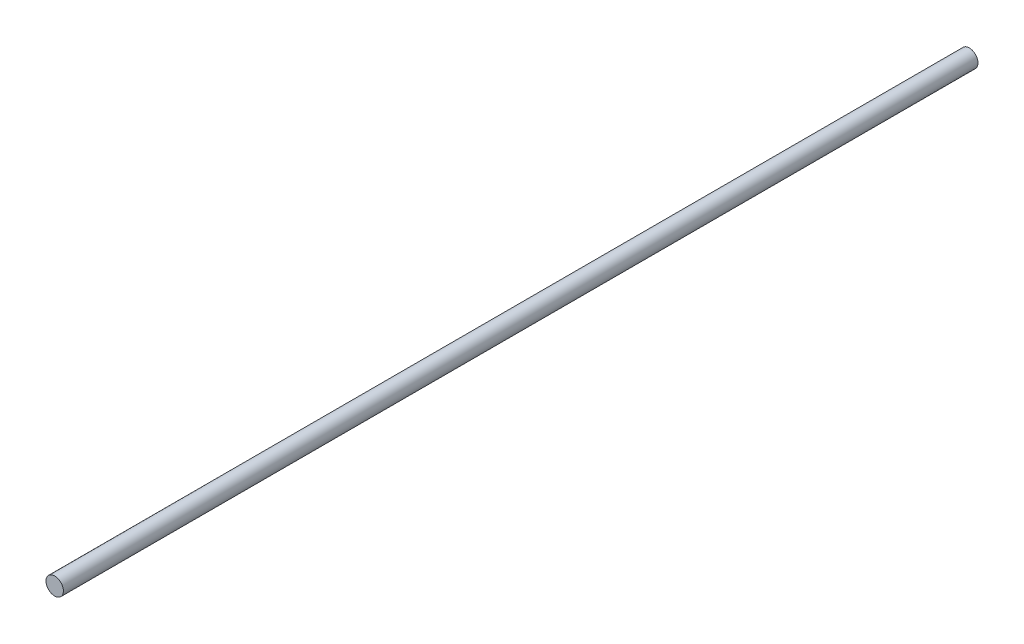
ISO-10303-21;
HEADER;
FILE_DESCRIPTION(('STEP AP214'),'2;1');
FILE_NAME('part.step','',(''),(''),'','','');
FILE_SCHEMA(('AUTOMOTIVE_DESIGN { 1 0 10303 214 1 1 1 1 }'));
ENDSEC;
DATA;
#1=APPLICATION_CONTEXT('core data for automotive mechanical design processes');
#2=APPLICATION_PROTOCOL_DEFINITION('international standard','automotive_design',2000,#1);
#3=PRODUCT_CONTEXT('',#1,'mechanical');
#4=PRODUCT('Part','Part','',(#3));
#5=PRODUCT_RELATED_PRODUCT_CATEGORY('part','',(#4));
#6=PRODUCT_DEFINITION_FORMATION('','',#4);
#7=PRODUCT_DEFINITION_CONTEXT('part definition',#1,'design');
#8=PRODUCT_DEFINITION('design','',#6,#7);
#9=PRODUCT_DEFINITION_SHAPE('','',#8);
#10=(LENGTH_UNIT() NAMED_UNIT(*) SI_UNIT(.MILLI.,.METRE.));
#11=(NAMED_UNIT(*) PLANE_ANGLE_UNIT() SI_UNIT($,.RADIAN.));
#12=(NAMED_UNIT(*) SI_UNIT($,.STERADIAN.) SOLID_ANGLE_UNIT());
#13=UNCERTAINTY_MEASURE_WITH_UNIT(LENGTH_MEASURE(1.E-05),#10,'distance_accuracy_value','');
#14=(GEOMETRIC_REPRESENTATION_CONTEXT(3) GLOBAL_UNCERTAINTY_ASSIGNED_CONTEXT((#13)) GLOBAL_UNIT_ASSIGNED_CONTEXT((#10,
#11,#12)) REPRESENTATION_CONTEXT('',''));
#15=CARTESIAN_POINT('',(0.,0.,0.));
#16=DIRECTION('',(0.,0.,1.));
#17=DIRECTION('',(1.,0.,0.));
#18=AXIS2_PLACEMENT_3D('',#15,#16,#17);
#19=CARTESIAN_POINT('',(0.,0.,-3150.));
#20=DIRECTION('',(0.,0.,1.));
#21=DIRECTION('',(1.,0.,0.));
#22=AXIS2_PLACEMENT_3D('',#19,#20,#21);
#23=CYLINDRICAL_SURFACE('',#22,30.);
#24=CARTESIAN_POINT('',(0.,0.,-3150.));
#25=DIRECTION('',(0.,0.,1.));
#26=DIRECTION('',(1.,0.,0.));
#27=AXIS2_PLACEMENT_3D('',#24,#25,#26);
#28=CIRCLE('',#27,30.);
#29=CARTESIAN_POINT('',(30.,0.,-3150.));
#30=VERTEX_POINT('',#29);
#31=EDGE_CURVE('E10',#30,#30,#28,.T.);
#32=CARTESIAN_POINT('',(0.,0.,0.));
#33=DIRECTION('',(0.,0.,1.));
#34=DIRECTION('',(1.,0.,0.));
#35=AXIS2_PLACEMENT_3D('',#32,#33,#34);
#36=CIRCLE('',#35,30.);
#37=CARTESIAN_POINT('',(30.,0.,0.));
#38=VERTEX_POINT('',#37);
#39=EDGE_CURVE('E40',#38,#38,#36,.T.);
#40=CARTESIAN_POINT('',(30.,0.,-3150.));
#41=CARTESIAN_POINT('',(30.,0.,-3117.1875));
#42=CARTESIAN_POINT('',(30.,0.,-3084.375));
#43=CARTESIAN_POINT('',(30.,0.,-3018.75));
#44=CARTESIAN_POINT('',(30.,0.,-2985.9375));
#45=CARTESIAN_POINT('',(30.,0.,-2920.3125));
#46=CARTESIAN_POINT('',(30.,0.,-2887.5));
#47=CARTESIAN_POINT('',(30.,0.,-2821.875));
#48=CARTESIAN_POINT('',(30.,0.,-2789.0625));
#49=CARTESIAN_POINT('',(30.,0.,-2723.4375));
#50=CARTESIAN_POINT('',(30.,0.,-2690.625));
#51=CARTESIAN_POINT('',(30.,0.,-2625.));
#52=CARTESIAN_POINT('',(30.,0.,-2592.1875));
#53=CARTESIAN_POINT('',(30.,0.,-2526.5625));
#54=CARTESIAN_POINT('',(30.,0.,-2493.75));
#55=CARTESIAN_POINT('',(30.,0.,-2428.125));
#56=CARTESIAN_POINT('',(30.,0.,-2395.3125));
#57=CARTESIAN_POINT('',(30.,0.,-2329.6875));
#58=CARTESIAN_POINT('',(30.,0.,-2296.875));
#59=CARTESIAN_POINT('',(30.,0.,-2231.25));
#60=CARTESIAN_POINT('',(30.,0.,-2198.4375));
#61=CARTESIAN_POINT('',(30.,0.,-2132.8125));
#62=CARTESIAN_POINT('',(30.,0.,-2100.));
#63=CARTESIAN_POINT('',(30.,0.,-2034.375));
#64=CARTESIAN_POINT('',(30.,0.,-2001.5625));
#65=CARTESIAN_POINT('',(30.,0.,-1935.9375));
#66=CARTESIAN_POINT('',(30.,0.,-1903.125));
#67=CARTESIAN_POINT('',(30.,0.,-1837.5));
#68=CARTESIAN_POINT('',(30.,0.,-1804.6875));
#69=CARTESIAN_POINT('',(30.,0.,-1739.0625));
#70=CARTESIAN_POINT('',(30.,0.,-1706.25));
#71=CARTESIAN_POINT('',(30.,0.,-1640.625));
#72=CARTESIAN_POINT('',(30.,0.,-1607.8125));
#73=CARTESIAN_POINT('',(30.,0.,-1542.1875));
#74=CARTESIAN_POINT('',(30.,0.,-1509.375));
#75=CARTESIAN_POINT('',(30.,0.,-1443.75));
#76=CARTESIAN_POINT('',(30.,0.,-1410.9375));
#77=CARTESIAN_POINT('',(30.,0.,-1345.3125));
#78=CARTESIAN_POINT('',(30.,0.,-1312.5));
#79=CARTESIAN_POINT('',(30.,0.,-1246.875));
#80=CARTESIAN_POINT('',(30.,0.,-1214.0625));
#81=CARTESIAN_POINT('',(30.,0.,-1148.4375));
#82=CARTESIAN_POINT('',(30.,0.,-1115.625));
#83=CARTESIAN_POINT('',(30.,0.,-1050.));
#84=CARTESIAN_POINT('',(30.,0.,-1017.1875));
#85=CARTESIAN_POINT('',(30.,0.,-951.5625));
#86=CARTESIAN_POINT('',(30.,0.,-918.75));
#87=CARTESIAN_POINT('',(30.,0.,-853.125));
#88=CARTESIAN_POINT('',(30.,0.,-820.3125));
#89=CARTESIAN_POINT('',(30.,0.,-754.6875));
#90=CARTESIAN_POINT('',(30.,0.,-721.875));
#91=CARTESIAN_POINT('',(30.,0.,-656.25));
#92=CARTESIAN_POINT('',(30.,0.,-623.4375));
#93=CARTESIAN_POINT('',(30.,0.,-557.8125));
#94=CARTESIAN_POINT('',(30.,0.,-525.));
#95=CARTESIAN_POINT('',(30.,0.,-459.375));
#96=CARTESIAN_POINT('',(30.,0.,-426.5625));
#97=CARTESIAN_POINT('',(30.,0.,-360.9375));
#98=CARTESIAN_POINT('',(30.,0.,-328.125));
#99=CARTESIAN_POINT('',(30.,0.,-262.5));
#100=CARTESIAN_POINT('',(30.,0.,-229.6875));
#101=CARTESIAN_POINT('',(30.,0.,-164.0625));
#102=CARTESIAN_POINT('',(30.,0.,-131.25));
#103=CARTESIAN_POINT('',(30.,0.,-65.6250000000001));
#104=CARTESIAN_POINT('',(30.,0.,-32.8125000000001));
#105=CARTESIAN_POINT('',(30.,0.,0.));
#106=B_SPLINE_CURVE_WITH_KNOTS('',3,(#40,#41,#42,#43,#44,#45,#46,#47,#48,#49,#50,#51,#52,#53,
#54,#55,#56,#57,#58,#59,#60,#61,#62,#63,#64,#65,#66,#67,#68,#69,#70,#71,#72,#73,#74,#75,#76,#77,
#78,#79,#80,#81,#82,#83,#84,#85,#86,#87,#88,#89,#90,#91,#92,#93,#94,#95,#96,#97,#98,#99,#100,
#101,#102,#103,#104,#105),.UNSPECIFIED.,.F.,.F.,(4,2,2,2,2,2,2,2,2,2,2,2,2,2,2,2,2,2,2,2,2,2,2,
2,2,2,2,2,2,2,2,2,4),(0.,98.4375000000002,196.875,295.3125,393.75,492.1875,590.625,689.0625,
787.500000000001,885.9375,984.375,1082.8125,1181.25,1279.6875,1378.125,1476.5625,1575.,
1673.4375,1771.875,1870.3125,1968.75,2067.1875,2165.625,2264.0625,2362.5,2460.9375,2559.375,
2657.8125,2756.25,2854.6875,2953.125,3051.5625,3150.),.UNSPECIFIED.);
#107=EDGE_CURVE('BSEAM37',#30,#38,#106,.T.);
#108=ORIENTED_EDGE('',*,*,#31,.T.);
#109=ORIENTED_EDGE('',*,*,#39,.F.);
#110=ORIENTED_EDGE('',*,*,#107,.T.);
#111=ORIENTED_EDGE('',*,*,#107,.F.);
#112=EDGE_LOOP('',(#108,#110,#109,#111));
#113=FACE_BOUND('',#112,.T.);
#114=ADVANCED_FACE('F37',(#113),#23,.T.);
#115=CARTESIAN_POINT('',(0.,0.,-3150.));
#116=DIRECTION('',(0.,0.,1.));
#117=DIRECTION('',(1.,0.,0.));
#118=AXIS2_PLACEMENT_3D('',#115,#116,#117);
#119=PLANE('',#118);
#120=ORIENTED_EDGE('',*,*,#31,.F.);
#121=EDGE_LOOP('',(#120));
#122=FACE_BOUND('',#121,.T.);
#123=ADVANCED_FACE('F54',(#122),#119,.F.);
#124=CARTESIAN_POINT('',(0.,0.,0.));
#125=DIRECTION('',(0.,0.,1.));
#126=DIRECTION('',(1.,0.,0.));
#127=AXIS2_PLACEMENT_3D('',#124,#125,#126);
#128=PLANE('',#127);
#129=ORIENTED_EDGE('',*,*,#39,.T.);
#130=EDGE_LOOP('',(#129));
#131=FACE_BOUND('',#130,.T.);
#132=ADVANCED_FACE('F51',(#131),#128,.T.);
#133=CLOSED_SHELL('',(#114,#123,#132));
#134=MANIFOLD_SOLID_BREP('B2',#133);
#135=ADVANCED_BREP_SHAPE_REPRESENTATION('',(#18,#134),#14);
#136=SHAPE_DEFINITION_REPRESENTATION(#9,#135);
ENDSEC;
END-ISO-10303-21;
